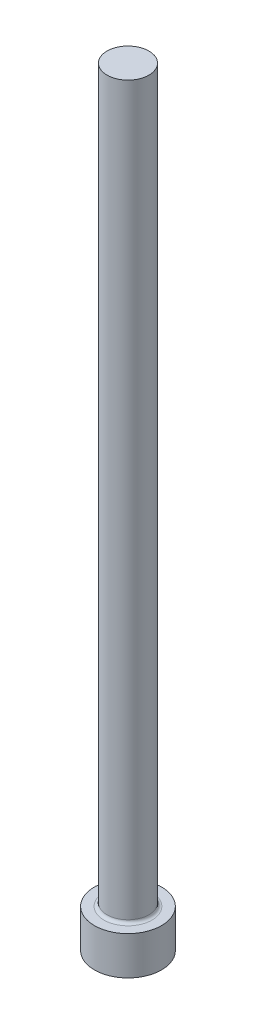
ISO-10303-21;
HEADER;
FILE_DESCRIPTION(('STEP AP214'),'2;1');
FILE_NAME('part.step','',(''),(''),'','','');
FILE_SCHEMA(('AUTOMOTIVE_DESIGN { 1 0 10303 214 1 1 1 1 }'));
ENDSEC;
DATA;
#1=APPLICATION_CONTEXT('core data for automotive mechanical design processes');
#2=APPLICATION_PROTOCOL_DEFINITION('international standard','automotive_design',2000,#1);
#3=PRODUCT_CONTEXT('',#1,'mechanical');
#4=PRODUCT('Part','Part','',(#3));
#5=PRODUCT_RELATED_PRODUCT_CATEGORY('part','',(#4));
#6=PRODUCT_DEFINITION_FORMATION('','',#4);
#7=PRODUCT_DEFINITION_CONTEXT('part definition',#1,'design');
#8=PRODUCT_DEFINITION('design','',#6,#7);
#9=PRODUCT_DEFINITION_SHAPE('','',#8);
#10=(LENGTH_UNIT() NAMED_UNIT(*) SI_UNIT(.MILLI.,.METRE.));
#11=(NAMED_UNIT(*) PLANE_ANGLE_UNIT() SI_UNIT($,.RADIAN.));
#12=(NAMED_UNIT(*) SI_UNIT($,.STERADIAN.) SOLID_ANGLE_UNIT());
#13=UNCERTAINTY_MEASURE_WITH_UNIT(LENGTH_MEASURE(1.E-05),#10,'distance_accuracy_value','');
#14=(GEOMETRIC_REPRESENTATION_CONTEXT(3) GLOBAL_UNCERTAINTY_ASSIGNED_CONTEXT((#13)) GLOBAL_UNIT_ASSIGNED_CONTEXT((#10,
#11,#12)) REPRESENTATION_CONTEXT('',''));
#15=CARTESIAN_POINT('',(0.,0.,0.));
#16=DIRECTION('',(0.,0.,1.));
#17=DIRECTION('',(1.,0.,0.));
#18=AXIS2_PLACEMENT_3D('',#15,#16,#17);
#19=CARTESIAN_POINT('',(0.,63.5,0.));
#20=DIRECTION('',(0.,-1.,0.));
#21=DIRECTION('',(0.,0.,-1.));
#22=AXIS2_PLACEMENT_3D('',#19,#20,#21);
#23=PLANE('',#22);
#24=CARTESIAN_POINT('',(0.,63.5,0.));
#25=DIRECTION('',(0.,1.,0.));
#26=DIRECTION('',(0.,0.,1.));
#27=AXIS2_PLACEMENT_3D('',#24,#25,#26);
#28=CIRCLE('',#27,1.7272);
#29=CARTESIAN_POINT('',(0.,63.5,1.7272));
#30=VERTEX_POINT('',#29);
#31=EDGE_CURVE('E10',#30,#30,#28,.T.);
#32=ORIENTED_EDGE('',*,*,#31,.T.);
#33=EDGE_LOOP('',(#32));
#34=FACE_BOUND('',#33,.T.);
#35=ADVANCED_FACE('F30',(#34),#23,.F.);
#36=CARTESIAN_POINT('',(0.,0.,0.));
#37=DIRECTION('',(0.,1.,0.));
#38=DIRECTION('',(0.,0.,1.));
#39=AXIS2_PLACEMENT_3D('',#36,#37,#38);
#40=CYLINDRICAL_SURFACE('',#39,1.7272);
#41=ORIENTED_EDGE('',*,*,#31,.F.);
#42=EDGE_LOOP('',(#41));
#43=FACE_BOUND('',#42,.T.);
#44=CARTESIAN_POINT('',(0.,3.429,0.));
#45=DIRECTION('',(0.,1.,0.));
#46=DIRECTION('',(0.,0.,1.));
#47=AXIS2_PLACEMENT_3D('',#44,#45,#46);
#48=CIRCLE('',#47,1.7272);
#49=CARTESIAN_POINT('',(0.,3.429,1.7272));
#50=VERTEX_POINT('',#49);
#51=EDGE_CURVE('E36',#50,#50,#48,.T.);
#52=ORIENTED_EDGE('',*,*,#51,.T.);
#53=EDGE_LOOP('',(#52));
#54=FACE_BOUND('',#53,.T.);
#55=ADVANCED_FACE('F65',(#43,#54),#40,.T.);
#56=CARTESIAN_POINT('',(0.,3.429,0.));
#57=DIRECTION('',(0.,1.,0.));
#58=DIRECTION('',(0.,0.,1.));
#59=AXIS2_PLACEMENT_3D('',#56,#57,#58);
#60=TOROIDAL_SURFACE('',#59,1.9812,0.254);
#61=ORIENTED_EDGE('',*,*,#51,.F.);
#62=EDGE_LOOP('',(#61));
#63=FACE_BOUND('',#62,.T.);
#64=CARTESIAN_POINT('',(0.,3.175,0.));
#65=DIRECTION('',(0.,1.,0.));
#66=DIRECTION('',(0.,0.,1.));
#67=AXIS2_PLACEMENT_3D('',#64,#65,#66);
#68=CIRCLE('',#67,1.9812);
#69=CARTESIAN_POINT('',(0.,3.175,1.9812));
#70=VERTEX_POINT('',#69);
#71=EDGE_CURVE('E40',#70,#70,#68,.T.);
#72=ORIENTED_EDGE('',*,*,#71,.T.);
#73=EDGE_LOOP('',(#72));
#74=FACE_BOUND('',#73,.T.);
#75=ADVANCED_FACE('F69',(#63,#74),#60,.F.);
#76=CARTESIAN_POINT('',(2.7686,3.175,0.));
#77=DIRECTION('',(0.,-1.,0.));
#78=DIRECTION('',(0.,0.,-1.));
#79=AXIS2_PLACEMENT_3D('',#76,#77,#78);
#80=PLANE('',#79);
#81=ORIENTED_EDGE('',*,*,#71,.F.);
#82=EDGE_LOOP('',(#81));
#83=FACE_BOUND('',#82,.T.);
#84=CARTESIAN_POINT('',(0.,3.175,0.));
#85=DIRECTION('',(0.,1.,0.));
#86=DIRECTION('',(0.,0.,1.));
#87=AXIS2_PLACEMENT_3D('',#84,#85,#86);
#88=CIRCLE('',#87,2.7686);
#89=CARTESIAN_POINT('',(0.,3.175,2.7686));
#90=VERTEX_POINT('',#89);
#91=EDGE_CURVE('E44',#90,#90,#88,.T.);
#92=ORIENTED_EDGE('',*,*,#91,.T.);
#93=EDGE_LOOP('',(#92));
#94=FACE_BOUND('',#93,.T.);
#95=ADVANCED_FACE('F61',(#83,#94),#80,.F.);
#96=CARTESIAN_POINT('',(0.,0.,0.));
#97=DIRECTION('',(0.,1.,0.));
#98=DIRECTION('',(0.,0.,1.));
#99=AXIS2_PLACEMENT_3D('',#96,#97,#98);
#100=CYLINDRICAL_SURFACE('',#99,2.7686);
#101=ORIENTED_EDGE('',*,*,#91,.F.);
#102=EDGE_LOOP('',(#101));
#103=FACE_BOUND('',#102,.T.);
#104=CARTESIAN_POINT('',(0.,0.,0.));
#105=DIRECTION('',(0.,1.,0.));
#106=DIRECTION('',(0.,0.,1.));
#107=AXIS2_PLACEMENT_3D('',#104,#105,#106);
#108=CIRCLE('',#107,2.7686);
#109=CARTESIAN_POINT('',(0.,0.,2.7686));
#110=VERTEX_POINT('',#109);
#111=EDGE_CURVE('E49',#110,#110,#108,.T.);
#112=ORIENTED_EDGE('',*,*,#111,.T.);
#113=EDGE_LOOP('',(#112));
#114=FACE_BOUND('',#113,.T.);
#115=ADVANCED_FACE('F53',(#103,#114),#100,.T.);
#116=CARTESIAN_POINT('',(0.,0.,0.));
#117=DIRECTION('',(0.,1.,0.));
#118=DIRECTION('',(0.,0.,1.));
#119=AXIS2_PLACEMENT_3D('',#116,#117,#118);
#120=PLANE('',#119);
#121=ORIENTED_EDGE('',*,*,#111,.F.);
#122=EDGE_LOOP('',(#121));
#123=FACE_BOUND('',#122,.T.);
#124=ADVANCED_FACE('F55',(#123),#120,.F.);
#125=CLOSED_SHELL('',(#35,#55,#75,#95,#115,#124));
#126=MANIFOLD_SOLID_BREP('B2',#125);
#127=ADVANCED_BREP_SHAPE_REPRESENTATION('',(#18,#126),#14);
#128=SHAPE_DEFINITION_REPRESENTATION(#9,#127);
ENDSEC;
END-ISO-10303-21;
